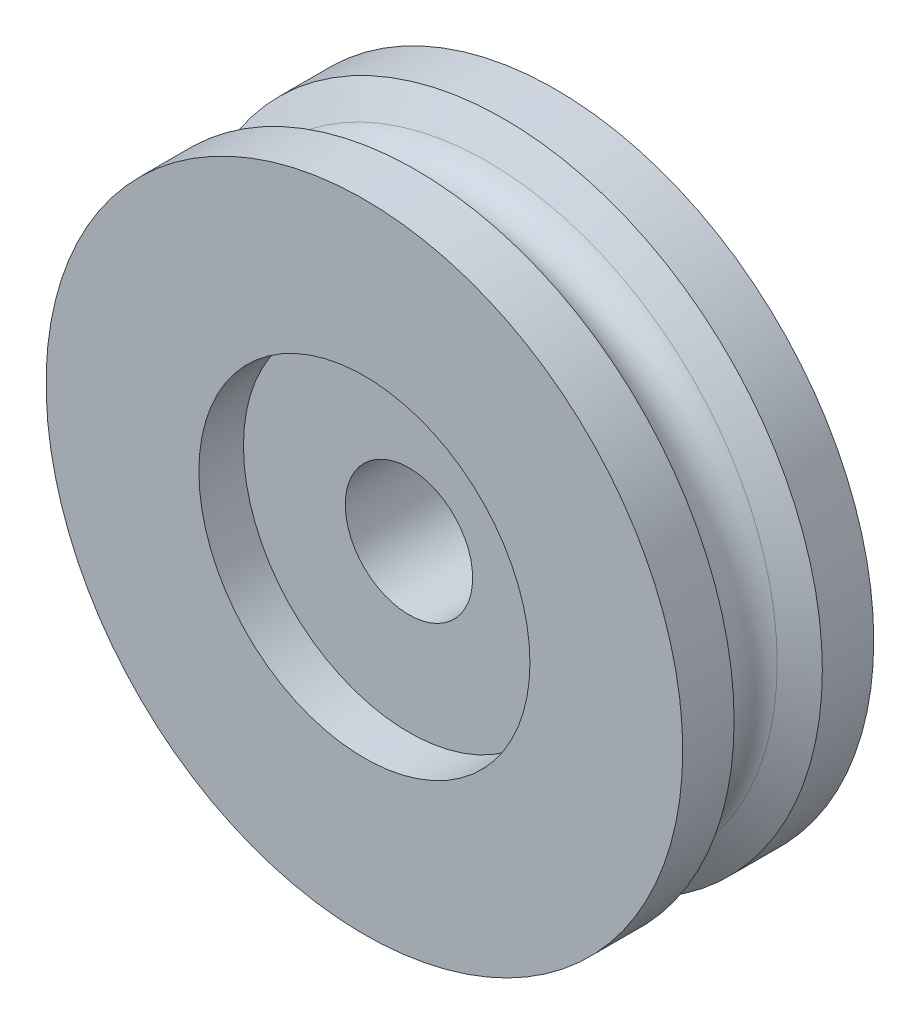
ISO-10303-21;
HEADER;
FILE_DESCRIPTION(('STEP AP214'),'2;1');
FILE_NAME('part.step','',(''),(''),'','','');
FILE_SCHEMA(('AUTOMOTIVE_DESIGN { 1 0 10303 214 1 1 1 1 }'));
ENDSEC;
DATA;
#1=APPLICATION_CONTEXT('core data for automotive mechanical design processes');
#2=APPLICATION_PROTOCOL_DEFINITION('international standard','automotive_design',2000,#1);
#3=PRODUCT_CONTEXT('',#1,'mechanical');
#4=PRODUCT('Part','Part','',(#3));
#5=PRODUCT_RELATED_PRODUCT_CATEGORY('part','',(#4));
#6=PRODUCT_DEFINITION_FORMATION('','',#4);
#7=PRODUCT_DEFINITION_CONTEXT('part definition',#1,'design');
#8=PRODUCT_DEFINITION('design','',#6,#7);
#9=PRODUCT_DEFINITION_SHAPE('','',#8);
#10=(LENGTH_UNIT() NAMED_UNIT(*) SI_UNIT(.MILLI.,.METRE.));
#11=(NAMED_UNIT(*) PLANE_ANGLE_UNIT() SI_UNIT($,.RADIAN.));
#12=(NAMED_UNIT(*) SI_UNIT($,.STERADIAN.) SOLID_ANGLE_UNIT());
#13=UNCERTAINTY_MEASURE_WITH_UNIT(LENGTH_MEASURE(1.E-05),#10,'distance_accuracy_value','');
#14=(GEOMETRIC_REPRESENTATION_CONTEXT(3) GLOBAL_UNCERTAINTY_ASSIGNED_CONTEXT((#13)) GLOBAL_UNIT_ASSIGNED_CONTEXT((#10,
#11,#12)) REPRESENTATION_CONTEXT('',''));
#15=CARTESIAN_POINT('',(0.,0.,0.));
#16=DIRECTION('',(0.,0.,1.));
#17=DIRECTION('',(1.,0.,0.));
#18=AXIS2_PLACEMENT_3D('',#15,#16,#17);
#19=CARTESIAN_POINT('',(0.,0.,-3.46410161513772));
#20=DIRECTION('',(0.,0.,-1.));
#21=DIRECTION('',(-1.,0.,0.));
#22=AXIS2_PLACEMENT_3D('',#19,#20,#21);
#23=CONICAL_SURFACE('',#22,25.,1.04719755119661);
#24=CARTESIAN_POINT('',(0.,0.,-2.16506350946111));
#25=DIRECTION('',(0.,0.,1.));
#26=DIRECTION('',(1.,0.,0.));
#27=AXIS2_PLACEMENT_3D('',#24,#25,#26);
#28=CIRCLE('',#27,22.75);
#29=CARTESIAN_POINT('',(22.75,0.,-2.16506350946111));
#30=VERTEX_POINT('',#29);
#31=EDGE_CURVE('E8',#30,#30,#28,.T.);
#32=ORIENTED_EDGE('',*,*,#31,.F.);
#33=EDGE_LOOP('',(#32));
#34=FACE_BOUND('',#33,.T.);
#35=CARTESIAN_POINT('',(0.,0.,-3.46410161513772));
#36=DIRECTION('',(0.,0.,1.));
#37=DIRECTION('',(1.,0.,0.));
#38=AXIS2_PLACEMENT_3D('',#35,#36,#37);
#39=CIRCLE('',#38,25.);
#40=CARTESIAN_POINT('',(25.,0.,-3.46410161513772));
#41=VERTEX_POINT('',#40);
#42=EDGE_CURVE('E52',#41,#41,#39,.T.);
#43=ORIENTED_EDGE('',*,*,#42,.T.);
#44=EDGE_LOOP('',(#43));
#45=FACE_BOUND('',#44,.T.);
#46=ADVANCED_FACE('F12',(#34,#45),#23,.T.);
#47=CARTESIAN_POINT('',(0.,0.,0.));
#48=DIRECTION('',(0.,0.,1.));
#49=DIRECTION('',(1.,0.,0.));
#50=AXIS2_PLACEMENT_3D('',#47,#48,#49);
#51=TOROIDAL_SURFACE('',#50,24.,2.5);
#52=CARTESIAN_POINT('',(0.,0.,2.16506350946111));
#53=DIRECTION('',(0.,0.,1.));
#54=DIRECTION('',(1.,0.,0.));
#55=AXIS2_PLACEMENT_3D('',#52,#53,#54);
#56=CIRCLE('',#55,22.75);
#57=CARTESIAN_POINT('',(22.75,0.,2.16506350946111));
#58=VERTEX_POINT('',#57);
#59=EDGE_CURVE('E18',#58,#58,#56,.T.);
#60=ORIENTED_EDGE('',*,*,#59,.F.);
#61=EDGE_LOOP('',(#60));
#62=FACE_BOUND('',#61,.T.);
#63=ORIENTED_EDGE('',*,*,#31,.T.);
#64=EDGE_LOOP('',(#63));
#65=FACE_BOUND('',#64,.T.);
#66=ADVANCED_FACE('F113',(#62,#65),#51,.F.);
#67=CARTESIAN_POINT('',(0.,0.,2.16506350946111));
#68=DIRECTION('',(0.,0.,1.));
#69=DIRECTION('',(1.,0.,0.));
#70=AXIS2_PLACEMENT_3D('',#67,#68,#69);
#71=CONICAL_SURFACE('',#70,22.75,1.04719755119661);
#72=CARTESIAN_POINT('',(0.,0.,3.46410161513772));
#73=DIRECTION('',(0.,0.,1.));
#74=DIRECTION('',(1.,0.,0.));
#75=AXIS2_PLACEMENT_3D('',#72,#73,#74);
#76=CIRCLE('',#75,25.);
#77=CARTESIAN_POINT('',(25.,0.,3.46410161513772));
#78=VERTEX_POINT('',#77);
#79=EDGE_CURVE('E22',#78,#78,#76,.T.);
#80=ORIENTED_EDGE('',*,*,#79,.F.);
#81=EDGE_LOOP('',(#80));
#82=FACE_BOUND('',#81,.T.);
#83=ORIENTED_EDGE('',*,*,#59,.T.);
#84=EDGE_LOOP('',(#83));
#85=FACE_BOUND('',#84,.T.);
#86=ADVANCED_FACE('F108',(#82,#85),#71,.T.);
#87=CARTESIAN_POINT('',(0.,0.,7.0891940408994));
#88=DIRECTION('',(0.,0.,1.));
#89=DIRECTION('',(1.,0.,0.));
#90=AXIS2_PLACEMENT_3D('',#87,#88,#89);
#91=CYLINDRICAL_SURFACE('',#90,25.);
#92=CARTESIAN_POINT('',(0.,0.,7.5));
#93=DIRECTION('',(0.,0.,1.));
#94=DIRECTION('',(1.,0.,0.));
#95=AXIS2_PLACEMENT_3D('',#92,#93,#94);
#96=CIRCLE('',#95,25.);
#97=CARTESIAN_POINT('',(25.,0.,7.5));
#98=VERTEX_POINT('',#97);
#99=EDGE_CURVE('E26',#98,#98,#96,.T.);
#100=ORIENTED_EDGE('',*,*,#99,.F.);
#101=EDGE_LOOP('',(#100));
#102=FACE_BOUND('',#101,.T.);
#103=ORIENTED_EDGE('',*,*,#79,.T.);
#104=EDGE_LOOP('',(#103));
#105=FACE_BOUND('',#104,.T.);
#106=ADVANCED_FACE('F102',(#102,#105),#91,.T.);
#107=CARTESIAN_POINT('',(0.,25.,7.5));
#108=DIRECTION('',(0.,0.,-1.));
#109=DIRECTION('',(-1.,0.,0.));
#110=AXIS2_PLACEMENT_3D('',#107,#108,#109);
#111=PLANE('',#110);
#112=CARTESIAN_POINT('',(0.,0.,7.5));
#113=DIRECTION('',(0.,0.,1.));
#114=DIRECTION('',(1.,0.,0.));
#115=AXIS2_PLACEMENT_3D('',#112,#113,#114);
#116=CIRCLE('',#115,13.);
#117=CARTESIAN_POINT('',(13.,0.,7.5));
#118=VERTEX_POINT('',#117);
#119=EDGE_CURVE('E31',#118,#118,#116,.T.);
#120=ORIENTED_EDGE('',*,*,#119,.F.);
#121=EDGE_LOOP('',(#120));
#122=FACE_BOUND('',#121,.T.);
#123=ORIENTED_EDGE('',*,*,#99,.T.);
#124=EDGE_LOOP('',(#123));
#125=FACE_BOUND('',#124,.T.);
#126=ADVANCED_FACE('F96',(#122,#125),#111,.F.);
#127=CARTESIAN_POINT('',(0.,0.,7.0891940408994));
#128=DIRECTION('',(0.,0.,1.));
#129=DIRECTION('',(1.,0.,0.));
#130=AXIS2_PLACEMENT_3D('',#127,#128,#129);
#131=CYLINDRICAL_SURFACE('',#130,13.);
#132=CARTESIAN_POINT('',(0.,0.,4.));
#133=DIRECTION('',(0.,0.,1.));
#134=DIRECTION('',(1.,0.,0.));
#135=AXIS2_PLACEMENT_3D('',#132,#133,#134);
#136=CIRCLE('',#135,13.);
#137=CARTESIAN_POINT('',(13.,0.,4.));
#138=VERTEX_POINT('',#137);
#139=EDGE_CURVE('E34',#138,#138,#136,.T.);
#140=ORIENTED_EDGE('',*,*,#139,.F.);
#141=EDGE_LOOP('',(#140));
#142=FACE_BOUND('',#141,.T.);
#143=ORIENTED_EDGE('',*,*,#119,.T.);
#144=EDGE_LOOP('',(#143));
#145=FACE_BOUND('',#144,.T.);
#146=ADVANCED_FACE('F90',(#142,#145),#131,.F.);
#147=CARTESIAN_POINT('',(0.,13.,4.));
#148=DIRECTION('',(0.,0.,-1.));
#149=DIRECTION('',(-1.,0.,0.));
#150=AXIS2_PLACEMENT_3D('',#147,#148,#149);
#151=PLANE('',#150);
#152=CARTESIAN_POINT('',(0.,0.,4.));
#153=DIRECTION('',(0.,0.,1.));
#154=DIRECTION('',(1.,0.,0.));
#155=AXIS2_PLACEMENT_3D('',#152,#153,#154);
#156=CIRCLE('',#155,5.);
#157=CARTESIAN_POINT('',(5.,0.,4.));
#158=VERTEX_POINT('',#157);
#159=EDGE_CURVE('E37',#158,#158,#156,.T.);
#160=ORIENTED_EDGE('',*,*,#159,.F.);
#161=EDGE_LOOP('',(#160));
#162=FACE_BOUND('',#161,.T.);
#163=ORIENTED_EDGE('',*,*,#139,.T.);
#164=EDGE_LOOP('',(#163));
#165=FACE_BOUND('',#164,.T.);
#166=ADVANCED_FACE('F84',(#162,#165),#151,.F.);
#167=CARTESIAN_POINT('',(0.,0.,7.0891940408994));
#168=DIRECTION('',(0.,0.,1.));
#169=DIRECTION('',(1.,0.,0.));
#170=AXIS2_PLACEMENT_3D('',#167,#168,#169);
#171=CYLINDRICAL_SURFACE('',#170,5.);
#172=CARTESIAN_POINT('',(0.,0.,-4.));
#173=DIRECTION('',(0.,0.,1.));
#174=DIRECTION('',(1.,0.,0.));
#175=AXIS2_PLACEMENT_3D('',#172,#173,#174);
#176=CIRCLE('',#175,5.);
#177=CARTESIAN_POINT('',(5.,0.,-4.));
#178=VERTEX_POINT('',#177);
#179=EDGE_CURVE('E40',#178,#178,#176,.T.);
#180=ORIENTED_EDGE('',*,*,#179,.F.);
#181=EDGE_LOOP('',(#180));
#182=FACE_BOUND('',#181,.T.);
#183=ORIENTED_EDGE('',*,*,#159,.T.);
#184=EDGE_LOOP('',(#183));
#185=FACE_BOUND('',#184,.T.);
#186=ADVANCED_FACE('F78',(#182,#185),#171,.F.);
#187=CARTESIAN_POINT('',(0.,5.,-4.));
#188=DIRECTION('',(0.,0.,1.));
#189=DIRECTION('',(1.,0.,0.));
#190=AXIS2_PLACEMENT_3D('',#187,#188,#189);
#191=PLANE('',#190);
#192=CARTESIAN_POINT('',(0.,0.,-4.));
#193=DIRECTION('',(0.,0.,1.));
#194=DIRECTION('',(1.,0.,0.));
#195=AXIS2_PLACEMENT_3D('',#192,#193,#194);
#196=CIRCLE('',#195,11.);
#197=CARTESIAN_POINT('',(11.,0.,-4.));
#198=VERTEX_POINT('',#197);
#199=EDGE_CURVE('E43',#198,#198,#196,.T.);
#200=ORIENTED_EDGE('',*,*,#199,.F.);
#201=EDGE_LOOP('',(#200));
#202=FACE_BOUND('',#201,.T.);
#203=ORIENTED_EDGE('',*,*,#179,.T.);
#204=EDGE_LOOP('',(#203));
#205=FACE_BOUND('',#204,.T.);
#206=ADVANCED_FACE('F72',(#202,#205),#191,.F.);
#207=CARTESIAN_POINT('',(0.,0.,7.0891940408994));
#208=DIRECTION('',(0.,0.,1.));
#209=DIRECTION('',(1.,0.,0.));
#210=AXIS2_PLACEMENT_3D('',#207,#208,#209);
#211=CYLINDRICAL_SURFACE('',#210,11.);
#212=CARTESIAN_POINT('',(0.,0.,-7.5));
#213=DIRECTION('',(0.,0.,1.));
#214=DIRECTION('',(1.,0.,0.));
#215=AXIS2_PLACEMENT_3D('',#212,#213,#214);
#216=CIRCLE('',#215,11.);
#217=CARTESIAN_POINT('',(11.,0.,-7.5));
#218=VERTEX_POINT('',#217);
#219=EDGE_CURVE('E46',#218,#218,#216,.T.);
#220=ORIENTED_EDGE('',*,*,#219,.F.);
#221=EDGE_LOOP('',(#220));
#222=FACE_BOUND('',#221,.T.);
#223=ORIENTED_EDGE('',*,*,#199,.T.);
#224=EDGE_LOOP('',(#223));
#225=FACE_BOUND('',#224,.T.);
#226=ADVANCED_FACE('F66',(#222,#225),#211,.F.);
#227=CARTESIAN_POINT('',(0.,11.,-7.5));
#228=DIRECTION('',(0.,0.,1.));
#229=DIRECTION('',(1.,0.,0.));
#230=AXIS2_PLACEMENT_3D('',#227,#228,#229);
#231=PLANE('',#230);
#232=CARTESIAN_POINT('',(0.,0.,-7.5));
#233=DIRECTION('',(0.,0.,1.));
#234=DIRECTION('',(1.,0.,0.));
#235=AXIS2_PLACEMENT_3D('',#232,#233,#234);
#236=CIRCLE('',#235,25.);
#237=CARTESIAN_POINT('',(25.,0.,-7.5));
#238=VERTEX_POINT('',#237);
#239=EDGE_CURVE('E49',#238,#238,#236,.T.);
#240=ORIENTED_EDGE('',*,*,#239,.F.);
#241=EDGE_LOOP('',(#240));
#242=FACE_BOUND('',#241,.T.);
#243=ORIENTED_EDGE('',*,*,#219,.T.);
#244=EDGE_LOOP('',(#243));
#245=FACE_BOUND('',#244,.T.);
#246=ADVANCED_FACE('F60',(#242,#245),#231,.F.);
#247=CARTESIAN_POINT('',(0.,0.,7.0891940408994));
#248=DIRECTION('',(0.,0.,1.));
#249=DIRECTION('',(1.,0.,0.));
#250=AXIS2_PLACEMENT_3D('',#247,#248,#249);
#251=CYLINDRICAL_SURFACE('',#250,25.);
#252=ORIENTED_EDGE('',*,*,#42,.F.);
#253=EDGE_LOOP('',(#252));
#254=FACE_BOUND('',#253,.T.);
#255=ORIENTED_EDGE('',*,*,#239,.T.);
#256=EDGE_LOOP('',(#255));
#257=FACE_BOUND('',#256,.T.);
#258=ADVANCED_FACE('F57',(#254,#257),#251,.T.);
#259=CLOSED_SHELL('',(#46,#66,#86,#106,#126,#146,#166,#186,#206,#226,#246,#258));
#260=MANIFOLD_SOLID_BREP('B1',#259);
#261=ADVANCED_BREP_SHAPE_REPRESENTATION('',(#18,#260),#14);
#262=SHAPE_DEFINITION_REPRESENTATION(#9,#261);
ENDSEC;
END-ISO-10303-21;
